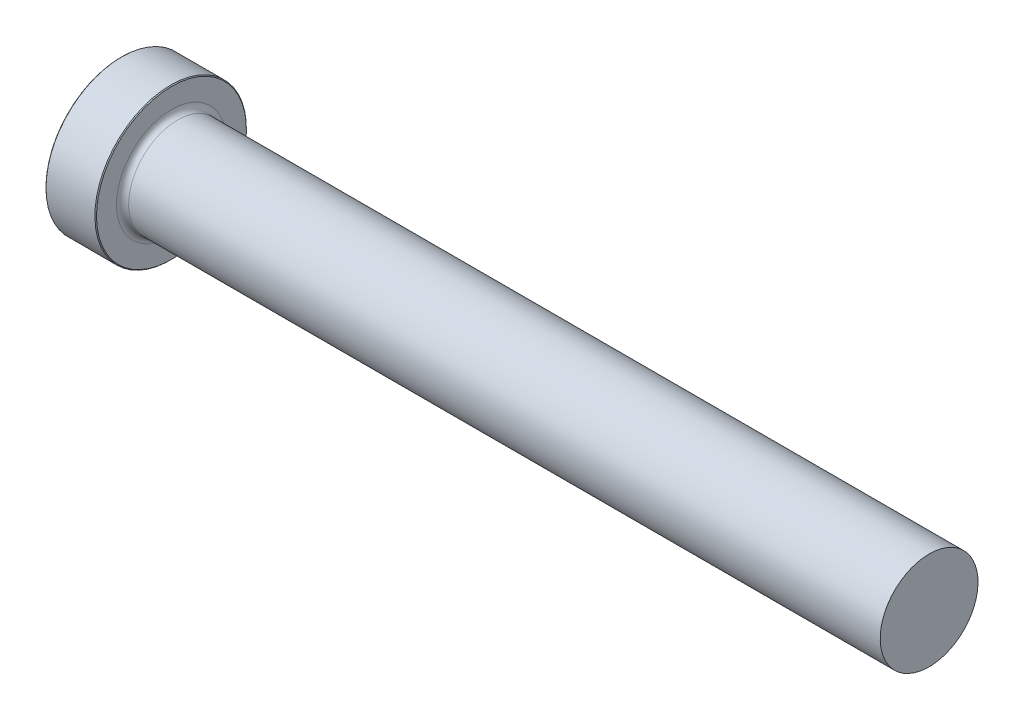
ISO-10303-21;
HEADER;
FILE_DESCRIPTION(('STEP AP214'),'2;1');
FILE_NAME('part.step','',(''),(''),'','','');
FILE_SCHEMA(('AUTOMOTIVE_DESIGN { 1 0 10303 214 1 1 1 1 }'));
ENDSEC;
DATA;
#1=APPLICATION_CONTEXT('core data for automotive mechanical design processes');
#2=APPLICATION_PROTOCOL_DEFINITION('international standard','automotive_design',2000,#1);
#3=PRODUCT_CONTEXT('',#1,'mechanical');
#4=PRODUCT('Part','Part','',(#3));
#5=PRODUCT_RELATED_PRODUCT_CATEGORY('part','',(#4));
#6=PRODUCT_DEFINITION_FORMATION('','',#4);
#7=PRODUCT_DEFINITION_CONTEXT('part definition',#1,'design');
#8=PRODUCT_DEFINITION('design','',#6,#7);
#9=PRODUCT_DEFINITION_SHAPE('','',#8);
#10=(LENGTH_UNIT() NAMED_UNIT(*) SI_UNIT(.MILLI.,.METRE.));
#11=(NAMED_UNIT(*) PLANE_ANGLE_UNIT() SI_UNIT($,.RADIAN.));
#12=(NAMED_UNIT(*) SI_UNIT($,.STERADIAN.) SOLID_ANGLE_UNIT());
#13=UNCERTAINTY_MEASURE_WITH_UNIT(LENGTH_MEASURE(1.E-05),#10,'distance_accuracy_value','');
#14=(GEOMETRIC_REPRESENTATION_CONTEXT(3) GLOBAL_UNCERTAINTY_ASSIGNED_CONTEXT((#13)) GLOBAL_UNIT_ASSIGNED_CONTEXT((#10,
#11,#12)) REPRESENTATION_CONTEXT('',''));
#15=CARTESIAN_POINT('',(0.,0.,0.));
#16=DIRECTION('',(0.,0.,1.));
#17=DIRECTION('',(1.,0.,0.));
#18=AXIS2_PLACEMENT_3D('',#15,#16,#17);
#19=CARTESIAN_POINT('',(101.6,6.14775249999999,0.));
#20=DIRECTION('',(1.,0.,0.));
#21=DIRECTION('',(0.,1.,0.));
#22=AXIS2_PLACEMENT_3D('',#19,#20,#21);
#23=PLANE('',#22);
#24=CARTESIAN_POINT('',(101.6,0.,0.));
#25=DIRECTION('',(1.,0.,0.));
#26=DIRECTION('',(0.,1.,0.));
#27=AXIS2_PLACEMENT_3D('',#24,#25,#26);
#28=CIRCLE('',#27,6.1477525);
#29=CARTESIAN_POINT('',(101.6,6.14775249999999,0.));
#30=VERTEX_POINT('',#29);
#31=EDGE_CURVE('E50',#30,#30,#28,.T.);
#32=ORIENTED_EDGE('',*,*,#31,.T.);
#33=EDGE_LOOP('',(#32));
#34=FACE_BOUND('',#33,.T.);
#35=ADVANCED_FACE('F30',(#34),#23,.T.);
#36=CARTESIAN_POINT('',(101.6,0.,0.));
#37=DIRECTION('',(1.,0.,0.));
#38=DIRECTION('',(0.,1.,0.));
#39=AXIS2_PLACEMENT_3D('',#36,#37,#38);
#40=CYLINDRICAL_SURFACE('',#39,6.1477525);
#41=CARTESIAN_POINT('',(7.11199999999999,0.,0.));
#42=DIRECTION('',(1.,0.,0.));
#43=DIRECTION('',(0.,1.,0.));
#44=AXIS2_PLACEMENT_3D('',#41,#42,#43);
#45=CIRCLE('',#44,6.14775249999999);
#46=CARTESIAN_POINT('',(7.11199999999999,6.14775249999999,0.));
#47=VERTEX_POINT('',#46);
#48=EDGE_CURVE('E53',#47,#47,#45,.T.);
#49=ORIENTED_EDGE('',*,*,#48,.T.);
#50=EDGE_LOOP('',(#49));
#51=FACE_BOUND('',#50,.T.);
#52=ORIENTED_EDGE('',*,*,#31,.F.);
#53=EDGE_LOOP('',(#52));
#54=FACE_BOUND('',#53,.T.);
#55=ADVANCED_FACE('F74',(#51,#54),#40,.T.);
#56=CARTESIAN_POINT('',(7.112,0.,0.));
#57=DIRECTION('',(1.,0.,0.));
#58=DIRECTION('',(0.,1.,0.));
#59=AXIS2_PLACEMENT_3D('',#56,#57,#58);
#60=TOROIDAL_SURFACE('',#59,6.90975249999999,0.761999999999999);
#61=CARTESIAN_POINT('',(6.34999999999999,0.,0.));
#62=DIRECTION('',(1.,0.,0.));
#63=DIRECTION('',(0.,1.,0.));
#64=AXIS2_PLACEMENT_3D('',#61,#62,#63);
#65=CIRCLE('',#64,6.90975249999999);
#66=CARTESIAN_POINT('',(6.34999999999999,6.90975249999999,0.));
#67=VERTEX_POINT('',#66);
#68=EDGE_CURVE('E56',#67,#67,#65,.T.);
#69=ORIENTED_EDGE('',*,*,#68,.T.);
#70=EDGE_LOOP('',(#69));
#71=FACE_BOUND('',#70,.T.);
#72=ORIENTED_EDGE('',*,*,#48,.F.);
#73=EDGE_LOOP('',(#72));
#74=FACE_BOUND('',#73,.T.);
#75=ADVANCED_FACE('F60',(#71,#74),#60,.F.);
#76=CARTESIAN_POINT('',(6.35,9.525,0.));
#77=DIRECTION('',(1.,0.,0.));
#78=DIRECTION('',(0.,1.,0.));
#79=AXIS2_PLACEMENT_3D('',#76,#77,#78);
#80=PLANE('',#79);
#81=CARTESIAN_POINT('',(6.35,0.,0.));
#82=DIRECTION('',(1.,0.,0.));
#83=DIRECTION('',(0.,1.,0.));
#84=AXIS2_PLACEMENT_3D('',#81,#82,#83);
#85=CIRCLE('',#84,9.42340000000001);
#86=CARTESIAN_POINT('',(6.35,9.42340000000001,0.));
#87=VERTEX_POINT('',#86);
#88=EDGE_CURVE('E10',#87,#87,#85,.T.);
#89=ORIENTED_EDGE('',*,*,#88,.T.);
#90=EDGE_LOOP('',(#89));
#91=FACE_BOUND('',#90,.T.);
#92=ORIENTED_EDGE('',*,*,#68,.F.);
#93=EDGE_LOOP('',(#92));
#94=FACE_BOUND('',#93,.T.);
#95=ADVANCED_FACE('F63',(#91,#94),#80,.T.);
#96=CARTESIAN_POINT('',(101.6,0.,0.));
#97=DIRECTION('',(1.,0.,0.));
#98=DIRECTION('',(0.,1.,0.));
#99=AXIS2_PLACEMENT_3D('',#96,#97,#98);
#100=CYLINDRICAL_SURFACE('',#99,9.525);
#101=CARTESIAN_POINT('',(0.101599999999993,0.,0.));
#102=DIRECTION('',(-1.,0.,0.));
#103=DIRECTION('',(0.,-1.,0.));
#104=AXIS2_PLACEMENT_3D('',#101,#102,#103);
#105=CIRCLE('',#104,9.525);
#106=CARTESIAN_POINT('',(0.101599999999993,-9.525,0.));
#107=VERTEX_POINT('',#106);
#108=EDGE_CURVE('E41',#107,#107,#105,.F.);
#109=ORIENTED_EDGE('',*,*,#108,.T.);
#110=EDGE_LOOP('',(#109));
#111=FACE_BOUND('',#110,.T.);
#112=CARTESIAN_POINT('',(6.24840000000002,0.,0.));
#113=DIRECTION('',(1.,0.,0.));
#114=DIRECTION('',(0.,1.,0.));
#115=AXIS2_PLACEMENT_3D('',#112,#113,#114);
#116=CIRCLE('',#115,9.525);
#117=CARTESIAN_POINT('',(6.24840000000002,9.525,0.));
#118=VERTEX_POINT('',#117);
#119=EDGE_CURVE('E45',#118,#118,#116,.F.);
#120=ORIENTED_EDGE('',*,*,#119,.T.);
#121=EDGE_LOOP('',(#120));
#122=FACE_BOUND('',#121,.T.);
#123=ADVANCED_FACE('F65',(#111,#122),#100,.T.);
#124=CARTESIAN_POINT('',(0.,0.,0.));
#125=DIRECTION('',(-1.,0.,0.));
#126=DIRECTION('',(0.,-1.,0.));
#127=AXIS2_PLACEMENT_3D('',#124,#125,#126);
#128=PLANE('',#127);
#129=CARTESIAN_POINT('',(0.,0.,0.));
#130=DIRECTION('',(-1.,0.,0.));
#131=DIRECTION('',(0.,-1.,0.));
#132=AXIS2_PLACEMENT_3D('',#129,#130,#131);
#133=CIRCLE('',#132,9.4234);
#134=CARTESIAN_POINT('',(0.,-9.4234,0.));
#135=VERTEX_POINT('',#134);
#136=EDGE_CURVE('E37',#135,#135,#133,.T.);
#137=ORIENTED_EDGE('',*,*,#136,.T.);
#138=EDGE_LOOP('',(#137));
#139=FACE_BOUND('',#138,.T.);
#140=ADVANCED_FACE('F71',(#139),#128,.T.);
#141=CARTESIAN_POINT('',(0.101599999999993,0.,0.));
#142=DIRECTION('',(1.,0.,0.));
#143=DIRECTION('',(0.,1.,0.));
#144=AXIS2_PLACEMENT_3D('',#141,#142,#143);
#145=CONICAL_SURFACE('',#144,9.525,0.785398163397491);
#146=ORIENTED_EDGE('',*,*,#136,.F.);
#147=EDGE_LOOP('',(#146));
#148=FACE_BOUND('',#147,.T.);
#149=ORIENTED_EDGE('',*,*,#108,.F.);
#150=EDGE_LOOP('',(#149));
#151=FACE_BOUND('',#150,.T.);
#152=ADVANCED_FACE('F84',(#148,#151),#145,.T.);
#153=CARTESIAN_POINT('',(6.34999999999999,0.,0.));
#154=DIRECTION('',(-1.,0.,0.));
#155=DIRECTION('',(0.,-1.,0.));
#156=AXIS2_PLACEMENT_3D('',#153,#154,#155);
#157=CONICAL_SURFACE('',#156,9.42340000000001,0.785398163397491);
#158=ORIENTED_EDGE('',*,*,#119,.F.);
#159=EDGE_LOOP('',(#158));
#160=FACE_BOUND('',#159,.T.);
#161=ORIENTED_EDGE('',*,*,#88,.F.);
#162=EDGE_LOOP('',(#161));
#163=FACE_BOUND('',#162,.T.);
#164=ADVANCED_FACE('F32',(#160,#163),#157,.T.);
#165=CLOSED_SHELL('',(#35,#55,#75,#95,#123,#140,#152,#164));
#166=MANIFOLD_SOLID_BREP('B2',#165);
#167=ADVANCED_BREP_SHAPE_REPRESENTATION('',(#18,#166),#14);
#168=SHAPE_DEFINITION_REPRESENTATION(#9,#167);
ENDSEC;
END-ISO-10303-21;
